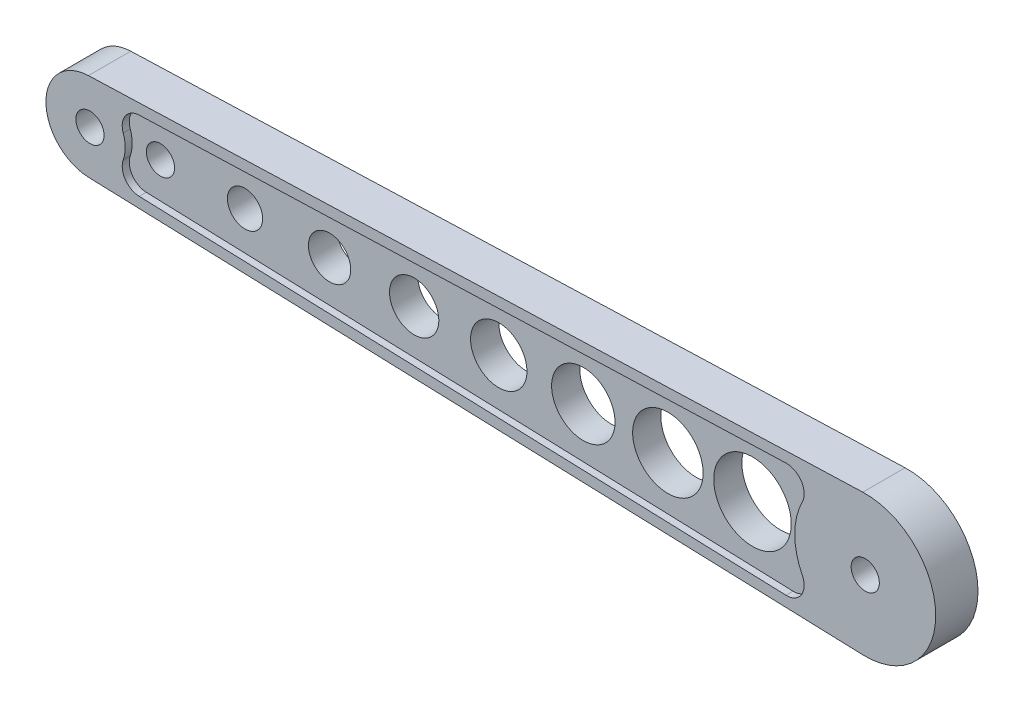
ISO-10303-21;
HEADER;
FILE_DESCRIPTION(('STEP AP214'),'2;1');
FILE_NAME('part.step','',(''),(''),'','','');
FILE_SCHEMA(('AUTOMOTIVE_DESIGN { 1 0 10303 214 1 1 1 1 }'));
ENDSEC;
DATA;
#1=APPLICATION_CONTEXT('core data for automotive mechanical design processes');
#2=APPLICATION_PROTOCOL_DEFINITION('international standard','automotive_design',2000,#1);
#3=PRODUCT_CONTEXT('',#1,'mechanical');
#4=PRODUCT('Part','Part','',(#3));
#5=PRODUCT_RELATED_PRODUCT_CATEGORY('part','',(#4));
#6=PRODUCT_DEFINITION_FORMATION('','',#4);
#7=PRODUCT_DEFINITION_CONTEXT('part definition',#1,'design');
#8=PRODUCT_DEFINITION('design','',#6,#7);
#9=PRODUCT_DEFINITION_SHAPE('','',#8);
#10=(LENGTH_UNIT() NAMED_UNIT(*) SI_UNIT(.MILLI.,.METRE.));
#11=(NAMED_UNIT(*) PLANE_ANGLE_UNIT() SI_UNIT($,.RADIAN.));
#12=(NAMED_UNIT(*) SI_UNIT($,.STERADIAN.) SOLID_ANGLE_UNIT());
#13=UNCERTAINTY_MEASURE_WITH_UNIT(LENGTH_MEASURE(1.E-05),#10,'distance_accuracy_value','');
#14=(GEOMETRIC_REPRESENTATION_CONTEXT(3) GLOBAL_UNCERTAINTY_ASSIGNED_CONTEXT((#13)) GLOBAL_UNIT_ASSIGNED_CONTEXT((#10,
#11,#12)) REPRESENTATION_CONTEXT('',''));
#15=CARTESIAN_POINT('',(0.,0.,0.));
#16=DIRECTION('',(0.,0.,1.));
#17=DIRECTION('',(1.,0.,0.));
#18=AXIS2_PLACEMENT_3D('',#15,#16,#17);
#19=CARTESIAN_POINT('',(-220.,0.,0.));
#20=DIRECTION('',(0.,0.,1.));
#21=DIRECTION('',(1.,0.,0.));
#22=AXIS2_PLACEMENT_3D('',#19,#20,#21);
#23=PLANE('',#22);
#24=CARTESIAN_POINT('',(0.,0.,0.));
#25=DIRECTION('',(0.,0.,1.));
#26=DIRECTION('',(1.,0.,0.));
#27=AXIS2_PLACEMENT_3D('',#24,#25,#26);
#28=CIRCLE('',#27,4.);
#29=CARTESIAN_POINT('',(4.,0.,0.));
#30=VERTEX_POINT('',#29);
#31=EDGE_CURVE('E327',#30,#30,#28,.T.);
#32=ORIENTED_EDGE('',*,*,#31,.T.);
#33=EDGE_LOOP('',(#32));
#34=FACE_BOUND('',#33,.T.);
#35=CARTESIAN_POINT('',(-220.,0.,0.));
#36=DIRECTION('',(0.,0.,1.));
#37=DIRECTION('',(1.,0.,0.));
#38=AXIS2_PLACEMENT_3D('',#35,#36,#37);
#39=CIRCLE('',#38,3.99999999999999);
#40=CARTESIAN_POINT('',(-216.,0.,0.));
#41=VERTEX_POINT('',#40);
#42=EDGE_CURVE('E342',#41,#41,#39,.T.);
#43=ORIENTED_EDGE('',*,*,#42,.T.);
#44=EDGE_LOOP('',(#43));
#45=FACE_BOUND('',#44,.T.);
#46=CARTESIAN_POINT('',(-220.,0.,0.));
#47=DIRECTION('',(0.,0.,1.));
#48=DIRECTION('',(1.,0.,0.));
#49=AXIS2_PLACEMENT_3D('',#46,#47,#48);
#50=CIRCLE('',#49,12.5);
#51=CARTESIAN_POINT('',(-220.426136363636,12.4927342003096,0.));
#52=VERTEX_POINT('',#51);
#53=CARTESIAN_POINT('',(-220.426136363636,-12.4927342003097,0.));
#54=VERTEX_POINT('',#53);
#55=EDGE_CURVE('E199',#52,#54,#50,.T.);
#56=ORIENTED_EDGE('',*,*,#55,.F.);
#57=DIRECTION('',(-0.999418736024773,-0.0340909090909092,0.));
#58=VECTOR('',#57,1.);
#59=CARTESIAN_POINT('',(-220.426136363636,12.4927342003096,0.));
#60=LINE('',#59,#58);
#61=CARTESIAN_POINT('',(-0.681818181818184,19.9883747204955,0.));
#62=VERTEX_POINT('',#61);
#63=EDGE_CURVE('E195',#62,#52,#60,.T.);
#64=ORIENTED_EDGE('',*,*,#63,.F.);
#65=CARTESIAN_POINT('',(0.,0.,0.));
#66=DIRECTION('',(0.,0.,1.));
#67=DIRECTION('',(1.,0.,0.));
#68=AXIS2_PLACEMENT_3D('',#65,#66,#67);
#69=CIRCLE('',#68,20.);
#70=CARTESIAN_POINT('',(-0.681818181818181,-19.9883747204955,0.));
#71=VERTEX_POINT('',#70);
#72=EDGE_CURVE('E356',#71,#62,#69,.T.);
#73=ORIENTED_EDGE('',*,*,#72,.F.);
#74=DIRECTION('',(0.999418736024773,-0.0340909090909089,0.));
#75=VECTOR('',#74,1.);
#76=CARTESIAN_POINT('',(-220.426136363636,-12.4927342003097,0.));
#77=LINE('',#76,#75);
#78=EDGE_CURVE('E354',#54,#71,#77,.T.);
#79=ORIENTED_EDGE('',*,*,#78,.F.);
#80=EDGE_LOOP('',(#56,#64,#73,#79));
#81=FACE_BOUND('',#80,.T.);
#82=DIRECTION('',(-0.999418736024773,-0.0340909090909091,0.));
#83=VECTOR('',#82,1.);
#84=CARTESIAN_POINT('',(-11.1090752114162,16.6309484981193,0.));
#85=LINE('',#84,#83);
#86=CARTESIAN_POINT('',(-22.4985095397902,16.2424465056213,0.));
#87=VERTEX_POINT('',#86);
#88=CARTESIAN_POINT('',(-206.023092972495,9.98228781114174,0.));
#89=VERTEX_POINT('',#88);
#90=EDGE_CURVE('E300',#87,#89,#85,.T.);
#91=ORIENTED_EDGE('',*,*,#90,.T.);
#92=CARTESIAN_POINT('',(-205.85263842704,4.98519413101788,0.));
#93=DIRECTION('',(0.,0.,1.));
#94=DIRECTION('',(1.,0.,0.));
#95=AXIS2_PLACEMENT_3D('',#92,#93,#94);
#96=CIRCLE('',#95,5.);
#97=CARTESIAN_POINT('',(-210.568425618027,3.32346275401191,0.));
#98=VERTEX_POINT('',#97);
#99=EDGE_CURVE('E270',#89,#98,#96,.T.);
#100=ORIENTED_EDGE('',*,*,#99,.T.);
#101=CARTESIAN_POINT('',(-220.,0.,0.));
#102=DIRECTION('',(0.,0.,-1.));
#103=DIRECTION('',(1.,0.,0.));
#104=AXIS2_PLACEMENT_3D('',#101,#102,#103);
#105=CIRCLE('',#104,9.99999999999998);
#106=CARTESIAN_POINT('',(-210.568425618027,-3.32346275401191,0.));
#107=VERTEX_POINT('',#106);
#108=EDGE_CURVE('E296',#98,#107,#105,.T.);
#109=ORIENTED_EDGE('',*,*,#108,.T.);
#110=CARTESIAN_POINT('',(-205.85263842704,-4.98519413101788,0.));
#111=DIRECTION('',(0.,0.,1.));
#112=DIRECTION('',(1.,0.,0.));
#113=AXIS2_PLACEMENT_3D('',#110,#111,#112);
#114=CIRCLE('',#113,5.);
#115=CARTESIAN_POINT('',(-206.023092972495,-9.98228781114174,0.));
#116=VERTEX_POINT('',#115);
#117=EDGE_CURVE('E268',#107,#116,#114,.T.);
#118=ORIENTED_EDGE('',*,*,#117,.T.);
#119=DIRECTION('',(0.999418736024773,-0.0340909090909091,0.));
#120=VECTOR('',#119,1.);
#121=CARTESIAN_POINT('',(-217.203179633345,-9.6009268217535,0.));
#122=LINE('',#121,#120);
#123=CARTESIAN_POINT('',(-22.4985095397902,-16.2424465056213,0.));
#124=VERTEX_POINT('',#123);
#125=EDGE_CURVE('E311',#116,#124,#122,.T.);
#126=ORIENTED_EDGE('',*,*,#125,.T.);
#127=CARTESIAN_POINT('',(-22.3280549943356,-11.2453528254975,0.));
#128=DIRECTION('',(0.,0.,1.));
#129=DIRECTION('',(1.,0.,0.));
#130=AXIS2_PLACEMENT_3D('',#127,#128,#129);
#131=CIRCLE('',#130,5.);
#132=CARTESIAN_POINT('',(-17.8624439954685,-8.99628226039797,0.));
#133=VERTEX_POINT('',#132);
#134=EDGE_CURVE('E45',#124,#133,#131,.T.);
#135=ORIENTED_EDGE('',*,*,#134,.T.);
#136=CARTESIAN_POINT('',(0.,0.,0.));
#137=DIRECTION('',(0.,0.,-1.));
#138=DIRECTION('',(1.,0.,0.));
#139=AXIS2_PLACEMENT_3D('',#136,#137,#138);
#140=CIRCLE('',#139,20.);
#141=CARTESIAN_POINT('',(-17.8624439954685,8.99628226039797,0.));
#142=VERTEX_POINT('',#141);
#143=EDGE_CURVE('E304',#133,#142,#140,.T.);
#144=ORIENTED_EDGE('',*,*,#143,.T.);
#145=CARTESIAN_POINT('',(-22.3280549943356,11.2453528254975,0.));
#146=DIRECTION('',(0.,0.,1.));
#147=DIRECTION('',(1.,0.,0.));
#148=AXIS2_PLACEMENT_3D('',#145,#146,#147);
#149=CIRCLE('',#148,5.);
#150=EDGE_CURVE('E11',#142,#87,#149,.T.);
#151=ORIENTED_EDGE('',*,*,#150,.T.);
#152=EDGE_LOOP('',(#91,#100,#109,#118,#126,#135,#144,#151));
#153=FACE_BOUND('',#152,.T.);
#154=ADVANCED_FACE('F36',(#34,#45,#81,#153),#23,.F.);
#155=CARTESIAN_POINT('',(-220.,0.,12.));
#156=DIRECTION('',(0.,0.,1.));
#157=DIRECTION('',(1.,0.,0.));
#158=AXIS2_PLACEMENT_3D('',#155,#156,#157);
#159=PLANE('',#158);
#160=CARTESIAN_POINT('',(-220.,0.,12.));
#161=DIRECTION('',(0.,0.,-1.));
#162=DIRECTION('',(1.,0.,0.));
#163=AXIS2_PLACEMENT_3D('',#160,#161,#162);
#164=CIRCLE('',#163,9.99999999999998);
#165=CARTESIAN_POINT('',(-210.568425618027,3.32346275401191,12.));
#166=VERTEX_POINT('',#165);
#167=CARTESIAN_POINT('',(-210.568425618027,-3.32346275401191,12.));
#168=VERTEX_POINT('',#167);
#169=EDGE_CURVE('E328',#166,#168,#164,.T.);
#170=ORIENTED_EDGE('',*,*,#169,.F.);
#171=CARTESIAN_POINT('',(-205.85263842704,4.98519413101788,12.));
#172=DIRECTION('',(0.,0.,1.));
#173=DIRECTION('',(1.,0.,0.));
#174=AXIS2_PLACEMENT_3D('',#171,#172,#173);
#175=CIRCLE('',#174,5.);
#176=CARTESIAN_POINT('',(-206.023092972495,9.98228781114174,12.));
#177=VERTEX_POINT('',#176);
#178=EDGE_CURVE('E239',#166,#177,#175,.F.);
#179=ORIENTED_EDGE('',*,*,#178,.T.);
#180=DIRECTION('',(-0.999418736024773,-0.0340909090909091,0.));
#181=VECTOR('',#180,1.);
#182=CARTESIAN_POINT('',(-11.1090752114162,16.6309484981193,12.));
#183=LINE('',#182,#181);
#184=CARTESIAN_POINT('',(-22.4985095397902,16.2424465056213,12.));
#185=VERTEX_POINT('',#184);
#186=EDGE_CURVE('E318',#185,#177,#183,.T.);
#187=ORIENTED_EDGE('',*,*,#186,.F.);
#188=CARTESIAN_POINT('',(-22.3280549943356,11.2453528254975,12.));
#189=DIRECTION('',(0.,0.,1.));
#190=DIRECTION('',(1.,0.,0.));
#191=AXIS2_PLACEMENT_3D('',#188,#189,#190);
#192=CIRCLE('',#191,5.);
#193=CARTESIAN_POINT('',(-17.8624439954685,8.99628226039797,12.));
#194=VERTEX_POINT('',#193);
#195=EDGE_CURVE('E235',#185,#194,#192,.F.);
#196=ORIENTED_EDGE('',*,*,#195,.T.);
#197=CARTESIAN_POINT('',(0.,0.,12.));
#198=DIRECTION('',(0.,0.,-1.));
#199=DIRECTION('',(1.,0.,0.));
#200=AXIS2_PLACEMENT_3D('',#197,#198,#199);
#201=CIRCLE('',#200,20.);
#202=CARTESIAN_POINT('',(-17.8624439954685,-8.99628226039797,12.));
#203=VERTEX_POINT('',#202);
#204=EDGE_CURVE('E334',#203,#194,#201,.T.);
#205=ORIENTED_EDGE('',*,*,#204,.F.);
#206=CARTESIAN_POINT('',(-22.3280549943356,-11.2453528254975,12.));
#207=DIRECTION('',(0.,0.,1.));
#208=DIRECTION('',(1.,0.,0.));
#209=AXIS2_PLACEMENT_3D('',#206,#207,#208);
#210=CIRCLE('',#209,5.);
#211=CARTESIAN_POINT('',(-22.4985095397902,-16.2424465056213,12.));
#212=VERTEX_POINT('',#211);
#213=EDGE_CURVE('E233',#203,#212,#210,.F.);
#214=ORIENTED_EDGE('',*,*,#213,.T.);
#215=DIRECTION('',(0.999418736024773,-0.0340909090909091,0.));
#216=VECTOR('',#215,1.);
#217=CARTESIAN_POINT('',(-217.203179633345,-9.6009268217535,12.));
#218=LINE('',#217,#216);
#219=CARTESIAN_POINT('',(-206.023092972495,-9.98228781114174,12.));
#220=VERTEX_POINT('',#219);
#221=EDGE_CURVE('E331',#220,#212,#218,.T.);
#222=ORIENTED_EDGE('',*,*,#221,.F.);
#223=CARTESIAN_POINT('',(-205.85263842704,-4.98519413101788,12.));
#224=DIRECTION('',(0.,0.,1.));
#225=DIRECTION('',(1.,0.,0.));
#226=AXIS2_PLACEMENT_3D('',#223,#224,#225);
#227=CIRCLE('',#226,5.);
#228=EDGE_CURVE('E237',#220,#168,#227,.F.);
#229=ORIENTED_EDGE('',*,*,#228,.T.);
#230=EDGE_LOOP('',(#170,#179,#187,#196,#205,#214,#222,#229));
#231=FACE_BOUND('',#230,.T.);
#232=CARTESIAN_POINT('',(-220.,0.,12.));
#233=DIRECTION('',(0.,0.,1.));
#234=DIRECTION('',(1.,0.,0.));
#235=AXIS2_PLACEMENT_3D('',#232,#233,#234);
#236=CIRCLE('',#235,3.99999999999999);
#237=CARTESIAN_POINT('',(-216.,0.,12.));
#238=VERTEX_POINT('',#237);
#239=EDGE_CURVE('E345',#238,#238,#236,.T.);
#240=ORIENTED_EDGE('',*,*,#239,.F.);
#241=EDGE_LOOP('',(#240));
#242=FACE_BOUND('',#241,.T.);
#243=CARTESIAN_POINT('',(-220.,0.,12.));
#244=DIRECTION('',(0.,0.,1.));
#245=DIRECTION('',(1.,0.,0.));
#246=AXIS2_PLACEMENT_3D('',#243,#244,#245);
#247=CIRCLE('',#246,12.5);
#248=CARTESIAN_POINT('',(-220.426136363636,12.4927342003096,12.));
#249=VERTEX_POINT('',#248);
#250=CARTESIAN_POINT('',(-220.426136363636,-12.4927342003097,12.));
#251=VERTEX_POINT('',#250);
#252=EDGE_CURVE('E185',#249,#251,#247,.T.);
#253=ORIENTED_EDGE('',*,*,#252,.T.);
#254=DIRECTION('',(0.999418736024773,-0.0340909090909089,0.));
#255=VECTOR('',#254,1.);
#256=CARTESIAN_POINT('',(-220.426136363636,-12.4927342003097,12.));
#257=LINE('',#256,#255);
#258=CARTESIAN_POINT('',(-0.681818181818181,-19.9883747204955,12.));
#259=VERTEX_POINT('',#258);
#260=EDGE_CURVE('E174',#251,#259,#257,.T.);
#261=ORIENTED_EDGE('',*,*,#260,.T.);
#262=CARTESIAN_POINT('',(0.,0.,12.));
#263=DIRECTION('',(0.,0.,1.));
#264=DIRECTION('',(1.,0.,0.));
#265=AXIS2_PLACEMENT_3D('',#262,#263,#264);
#266=CIRCLE('',#265,20.);
#267=CARTESIAN_POINT('',(-0.681818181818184,19.9883747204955,12.));
#268=VERTEX_POINT('',#267);
#269=EDGE_CURVE('E184',#259,#268,#266,.T.);
#270=ORIENTED_EDGE('',*,*,#269,.T.);
#271=DIRECTION('',(-0.999418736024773,-0.0340909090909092,0.));
#272=VECTOR('',#271,1.);
#273=CARTESIAN_POINT('',(-220.426136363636,12.4927342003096,12.));
#274=LINE('',#273,#272);
#275=EDGE_CURVE('E191',#268,#249,#274,.T.);
#276=ORIENTED_EDGE('',*,*,#275,.T.);
#277=EDGE_LOOP('',(#253,#261,#270,#276));
#278=FACE_BOUND('',#277,.T.);
#279=CARTESIAN_POINT('',(0.,0.,12.));
#280=DIRECTION('',(0.,0.,1.));
#281=DIRECTION('',(1.,0.,0.));
#282=AXIS2_PLACEMENT_3D('',#279,#280,#281);
#283=CIRCLE('',#282,4.);
#284=CARTESIAN_POINT('',(4.,0.,12.));
#285=VERTEX_POINT('',#284);
#286=EDGE_CURVE('E339',#285,#285,#283,.T.);
#287=ORIENTED_EDGE('',*,*,#286,.F.);
#288=EDGE_LOOP('',(#287));
#289=FACE_BOUND('',#288,.T.);
#290=ADVANCED_FACE('F188',(#231,#242,#278,#289),#159,.T.);
#291=CARTESIAN_POINT('',(-220.,0.,12.));
#292=DIRECTION('',(0.,0.,-1.));
#293=DIRECTION('',(-1.,0.,0.));
#294=AXIS2_PLACEMENT_3D('',#291,#292,#293);
#295=CYLINDRICAL_SURFACE('',#294,12.5);
#296=ORIENTED_EDGE('',*,*,#55,.T.);
#297=DIRECTION('',(0.,0.,-1.));
#298=VECTOR('',#297,1.);
#299=CARTESIAN_POINT('',(-220.426136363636,-12.4927342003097,12.));
#300=LINE('',#299,#298);
#301=EDGE_CURVE('E178',#251,#54,#300,.T.);
#302=ORIENTED_EDGE('',*,*,#301,.F.);
#303=ORIENTED_EDGE('',*,*,#252,.F.);
#304=DIRECTION('',(0.,0.,-1.));
#305=VECTOR('',#304,1.);
#306=CARTESIAN_POINT('',(-220.426136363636,12.4927342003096,12.));
#307=LINE('',#306,#305);
#308=EDGE_CURVE('E352',#249,#52,#307,.T.);
#309=ORIENTED_EDGE('',*,*,#308,.T.);
#310=EDGE_LOOP('',(#296,#302,#303,#309));
#311=FACE_BOUND('',#310,.T.);
#312=ADVANCED_FACE('F197',(#311),#295,.T.);
#313=CARTESIAN_POINT('',(-220.426136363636,-12.4927342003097,12.));
#314=DIRECTION('',(0.034090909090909,0.999418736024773,0.));
#315=DIRECTION('',(-0.999418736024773,0.034090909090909,0.));
#316=AXIS2_PLACEMENT_3D('',#313,#314,#315);
#317=PLANE('',#316);
#318=ORIENTED_EDGE('',*,*,#78,.T.);
#319=DIRECTION('',(0.,0.,-1.));
#320=VECTOR('',#319,1.);
#321=CARTESIAN_POINT('',(-0.681818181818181,-19.9883747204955,12.));
#322=LINE('',#321,#320);
#323=EDGE_CURVE('E181',#259,#71,#322,.T.);
#324=ORIENTED_EDGE('',*,*,#323,.F.);
#325=ORIENTED_EDGE('',*,*,#260,.F.);
#326=ORIENTED_EDGE('',*,*,#301,.T.);
#327=EDGE_LOOP('',(#318,#324,#325,#326));
#328=FACE_BOUND('',#327,.T.);
#329=ADVANCED_FACE('F176',(#328),#317,.F.);
#330=CARTESIAN_POINT('',(0.,0.,12.));
#331=DIRECTION('',(0.,0.,-1.));
#332=DIRECTION('',(-1.,0.,0.));
#333=AXIS2_PLACEMENT_3D('',#330,#331,#332);
#334=CYLINDRICAL_SURFACE('',#333,20.);
#335=ORIENTED_EDGE('',*,*,#72,.T.);
#336=DIRECTION('',(0.,0.,-1.));
#337=VECTOR('',#336,1.);
#338=CARTESIAN_POINT('',(-0.681818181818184,19.9883747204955,12.));
#339=LINE('',#338,#337);
#340=EDGE_CURVE('E204',#268,#62,#339,.T.);
#341=ORIENTED_EDGE('',*,*,#340,.F.);
#342=ORIENTED_EDGE('',*,*,#269,.F.);
#343=ORIENTED_EDGE('',*,*,#323,.T.);
#344=EDGE_LOOP('',(#335,#341,#342,#343));
#345=FACE_BOUND('',#344,.T.);
#346=ADVANCED_FACE('F367',(#345),#334,.T.);
#347=CARTESIAN_POINT('',(-220.426136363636,12.4927342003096,12.));
#348=DIRECTION('',(0.0340909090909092,-0.999418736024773,0.));
#349=DIRECTION('',(0.999418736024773,0.0340909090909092,0.));
#350=AXIS2_PLACEMENT_3D('',#347,#348,#349);
#351=PLANE('',#350);
#352=ORIENTED_EDGE('',*,*,#63,.T.);
#353=ORIENTED_EDGE('',*,*,#308,.F.);
#354=ORIENTED_EDGE('',*,*,#275,.F.);
#355=ORIENTED_EDGE('',*,*,#340,.T.);
#356=EDGE_LOOP('',(#352,#353,#354,#355));
#357=FACE_BOUND('',#356,.T.);
#358=ADVANCED_FACE('F363',(#357),#351,.F.);
#359=CARTESIAN_POINT('',(-220.,0.,12.));
#360=DIRECTION('',(0.,0.,-1.));
#361=DIRECTION('',(-1.,0.,0.));
#362=AXIS2_PLACEMENT_3D('',#359,#360,#361);
#363=CYLINDRICAL_SURFACE('',#362,3.99999999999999);
#364=ORIENTED_EDGE('',*,*,#239,.T.);
#365=EDGE_LOOP('',(#364));
#366=FACE_BOUND('',#365,.T.);
#367=ORIENTED_EDGE('',*,*,#42,.F.);
#368=EDGE_LOOP('',(#367));
#369=FACE_BOUND('',#368,.T.);
#370=ADVANCED_FACE('F374',(#366,#369),#363,.F.);
#371=CARTESIAN_POINT('',(0.,0.,12.));
#372=DIRECTION('',(0.,0.,-1.));
#373=DIRECTION('',(-1.,0.,0.));
#374=AXIS2_PLACEMENT_3D('',#371,#372,#373);
#375=CYLINDRICAL_SURFACE('',#374,4.);
#376=ORIENTED_EDGE('',*,*,#286,.T.);
#377=EDGE_LOOP('',(#376));
#378=FACE_BOUND('',#377,.T.);
#379=ORIENTED_EDGE('',*,*,#31,.F.);
#380=EDGE_LOOP('',(#379));
#381=FACE_BOUND('',#380,.T.);
#382=ADVANCED_FACE('F389',(#378,#381),#375,.F.);
#383=CARTESIAN_POINT('',(-220.,0.,10.));
#384=DIRECTION('',(0.,0.,1.));
#385=DIRECTION('',(1.,0.,0.));
#386=AXIS2_PLACEMENT_3D('',#383,#384,#385);
#387=CYLINDRICAL_SURFACE('',#386,9.99999999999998);
#388=ORIENTED_EDGE('',*,*,#169,.T.);
#389=DIRECTION('',(0.,0.,1.));
#390=VECTOR('',#389,1.);
#391=CARTESIAN_POINT('',(-210.568425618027,-3.32346275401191,10.));
#392=LINE('',#391,#390);
#393=CARTESIAN_POINT('',(-210.568425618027,-3.32346275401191,10.));
#394=VERTEX_POINT('',#393);
#395=EDGE_CURVE('E231',#168,#394,#392,.F.);
#396=ORIENTED_EDGE('',*,*,#395,.T.);
#397=CARTESIAN_POINT('',(-220.,0.,10.));
#398=DIRECTION('',(0.,0.,-1.));
#399=DIRECTION('',(1.,0.,0.));
#400=AXIS2_PLACEMENT_3D('',#397,#398,#399);
#401=CIRCLE('',#400,9.99999999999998);
#402=CARTESIAN_POINT('',(-210.568425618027,3.32346275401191,10.));
#403=VERTEX_POINT('',#402);
#404=EDGE_CURVE('E314',#403,#394,#401,.T.);
#405=ORIENTED_EDGE('',*,*,#404,.F.);
#406=DIRECTION('',(0.,0.,1.));
#407=VECTOR('',#406,1.);
#408=CARTESIAN_POINT('',(-210.568425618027,3.32346275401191,10.));
#409=LINE('',#408,#407);
#410=EDGE_CURVE('E228',#403,#166,#409,.T.);
#411=ORIENTED_EDGE('',*,*,#410,.T.);
#412=EDGE_LOOP('',(#388,#396,#405,#411));
#413=FACE_BOUND('',#412,.T.);
#414=ADVANCED_FACE('F393',(#413),#387,.T.);
#415=CARTESIAN_POINT('',(-11.1090752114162,16.6309484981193,10.));
#416=DIRECTION('',(-0.0340909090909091,0.999418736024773,0.));
#417=DIRECTION('',(-0.999418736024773,-0.0340909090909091,0.));
#418=AXIS2_PLACEMENT_3D('',#415,#416,#417);
#419=PLANE('',#418);
#420=DIRECTION('',(-0.999418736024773,-0.0340909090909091,0.));
#421=VECTOR('',#420,1.);
#422=CARTESIAN_POINT('',(-11.1090752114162,16.6309484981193,10.));
#423=LINE('',#422,#421);
#424=CARTESIAN_POINT('',(-22.4985095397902,16.2424465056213,10.));
#425=VERTEX_POINT('',#424);
#426=CARTESIAN_POINT('',(-206.023092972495,9.98228781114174,10.));
#427=VERTEX_POINT('',#426);
#428=EDGE_CURVE('E324',#425,#427,#423,.T.);
#429=ORIENTED_EDGE('',*,*,#428,.F.);
#430=DIRECTION('',(0.,0.,-1.));
#431=VECTOR('',#430,1.);
#432=CARTESIAN_POINT('',(-22.4985095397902,16.2424465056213,12.));
#433=LINE('',#432,#431);
#434=EDGE_CURVE('E225',#425,#185,#433,.F.);
#435=ORIENTED_EDGE('',*,*,#434,.T.);
#436=ORIENTED_EDGE('',*,*,#186,.T.);
#437=DIRECTION('',(0.,0.,-1.));
#438=VECTOR('',#437,1.);
#439=CARTESIAN_POINT('',(-206.023092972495,9.98228781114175,10.));
#440=LINE('',#439,#438);
#441=EDGE_CURVE('E223',#177,#427,#440,.T.);
#442=ORIENTED_EDGE('',*,*,#441,.T.);
#443=EDGE_LOOP('',(#429,#435,#436,#442));
#444=FACE_BOUND('',#443,.T.);
#445=ADVANCED_FACE('F397',(#444),#419,.F.);
#446=CARTESIAN_POINT('',(0.,0.,10.));
#447=DIRECTION('',(0.,0.,1.));
#448=DIRECTION('',(1.,0.,0.));
#449=AXIS2_PLACEMENT_3D('',#446,#447,#448);
#450=CYLINDRICAL_SURFACE('',#449,20.);
#451=CARTESIAN_POINT('',(0.,0.,10.));
#452=DIRECTION('',(0.,0.,-1.));
#453=DIRECTION('',(1.,0.,0.));
#454=AXIS2_PLACEMENT_3D('',#451,#452,#453);
#455=CIRCLE('',#454,20.);
#456=CARTESIAN_POINT('',(-17.8624439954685,-8.99628226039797,10.));
#457=VERTEX_POINT('',#456);
#458=CARTESIAN_POINT('',(-17.8624439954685,8.99628226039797,10.));
#459=VERTEX_POINT('',#458);
#460=EDGE_CURVE('E321',#457,#459,#455,.T.);
#461=ORIENTED_EDGE('',*,*,#460,.F.);
#462=DIRECTION('',(0.,0.,1.));
#463=VECTOR('',#462,1.);
#464=CARTESIAN_POINT('',(-17.8624439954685,-8.99628226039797,10.));
#465=LINE('',#464,#463);
#466=EDGE_CURVE('E202',#457,#203,#465,.T.);
#467=ORIENTED_EDGE('',*,*,#466,.T.);
#468=ORIENTED_EDGE('',*,*,#204,.T.);
#469=DIRECTION('',(0.,0.,1.));
#470=VECTOR('',#469,1.);
#471=CARTESIAN_POINT('',(-17.8624439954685,8.99628226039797,10.));
#472=LINE('',#471,#470);
#473=EDGE_CURVE('E200',#194,#459,#472,.F.);
#474=ORIENTED_EDGE('',*,*,#473,.T.);
#475=EDGE_LOOP('',(#461,#467,#468,#474));
#476=FACE_BOUND('',#475,.T.);
#477=ADVANCED_FACE('F403',(#476),#450,.T.);
#478=CARTESIAN_POINT('',(-217.203179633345,-9.6009268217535,10.));
#479=DIRECTION('',(-0.0340909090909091,-0.999418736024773,0.));
#480=DIRECTION('',(0.999418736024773,-0.0340909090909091,0.));
#481=AXIS2_PLACEMENT_3D('',#478,#479,#480);
#482=PLANE('',#481);
#483=ORIENTED_EDGE('',*,*,#221,.T.);
#484=DIRECTION('',(0.,0.,-1.));
#485=VECTOR('',#484,1.);
#486=CARTESIAN_POINT('',(-22.4985095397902,-16.2424465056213,10.));
#487=LINE('',#486,#485);
#488=CARTESIAN_POINT('',(-22.4985095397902,-16.2424465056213,10.));
#489=VERTEX_POINT('',#488);
#490=EDGE_CURVE('E213',#212,#489,#487,.T.);
#491=ORIENTED_EDGE('',*,*,#490,.T.);
#492=DIRECTION('',(0.999418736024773,-0.0340909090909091,0.));
#493=VECTOR('',#492,1.);
#494=CARTESIAN_POINT('',(-217.203179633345,-9.6009268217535,10.));
#495=LINE('',#494,#493);
#496=CARTESIAN_POINT('',(-206.023092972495,-9.98228781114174,10.));
#497=VERTEX_POINT('',#496);
#498=EDGE_CURVE('E317',#497,#489,#495,.T.);
#499=ORIENTED_EDGE('',*,*,#498,.F.);
#500=DIRECTION('',(0.,0.,-1.));
#501=VECTOR('',#500,1.);
#502=CARTESIAN_POINT('',(-206.023092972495,-9.98228781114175,12.));
#503=LINE('',#502,#501);
#504=EDGE_CURVE('E210',#497,#220,#503,.F.);
#505=ORIENTED_EDGE('',*,*,#504,.T.);
#506=EDGE_LOOP('',(#483,#491,#499,#505));
#507=FACE_BOUND('',#506,.T.);
#508=ADVANCED_FACE('F399',(#507),#482,.F.);
#509=CARTESIAN_POINT('',(-220.,0.,10.));
#510=DIRECTION('',(0.,0.,1.));
#511=DIRECTION('',(1.,0.,0.));
#512=AXIS2_PLACEMENT_3D('',#509,#510,#511);
#513=PLANE('',#512);
#514=CARTESIAN_POINT('',(-106.,0.,10.));
#515=DIRECTION('',(0.,0.,1.));
#516=DIRECTION('',(1.,0.,0.));
#517=AXIS2_PLACEMENT_3D('',#514,#515,#516);
#518=CIRCLE('',#517,7.99999999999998);
#519=CARTESIAN_POINT('',(-98.0000000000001,0.,10.));
#520=VERTEX_POINT('',#519);
#521=EDGE_CURVE('E483',#520,#520,#518,.T.);
#522=ORIENTED_EDGE('',*,*,#521,.F.);
#523=EDGE_LOOP('',(#522));
#524=FACE_BOUND('',#523,.T.);
#525=CARTESIAN_POINT('',(-202.,0.,10.));
#526=DIRECTION('',(0.,0.,1.));
#527=DIRECTION('',(1.,0.,0.));
#528=AXIS2_PLACEMENT_3D('',#525,#526,#527);
#529=CIRCLE('',#528,3.99999999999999);
#530=CARTESIAN_POINT('',(-198.,0.,10.));
#531=VERTEX_POINT('',#530);
#532=EDGE_CURVE('E277',#531,#531,#529,.T.);
#533=ORIENTED_EDGE('',*,*,#532,.F.);
#534=EDGE_LOOP('',(#533));
#535=FACE_BOUND('',#534,.T.);
#536=CARTESIAN_POINT('',(-178.,0.,10.));
#537=DIRECTION('',(0.,0.,1.));
#538=DIRECTION('',(1.,0.,0.));
#539=AXIS2_PLACEMENT_3D('',#536,#537,#538);
#540=CIRCLE('',#539,4.99999999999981);
#541=CARTESIAN_POINT('',(-173.,0.,10.));
#542=VERTEX_POINT('',#541);
#543=EDGE_CURVE('E472',#542,#542,#540,.T.);
#544=ORIENTED_EDGE('',*,*,#543,.F.);
#545=EDGE_LOOP('',(#544));
#546=FACE_BOUND('',#545,.T.);
#547=CARTESIAN_POINT('',(-154.,0.,10.));
#548=DIRECTION('',(0.,0.,1.));
#549=DIRECTION('',(1.,0.,0.));
#550=AXIS2_PLACEMENT_3D('',#547,#548,#549);
#551=CIRCLE('',#550,6.0000000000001);
#552=CARTESIAN_POINT('',(-148.,0.,10.));
#553=VERTEX_POINT('',#552);
#554=EDGE_CURVE('E475',#553,#553,#551,.T.);
#555=ORIENTED_EDGE('',*,*,#554,.F.);
#556=EDGE_LOOP('',(#555));
#557=FACE_BOUND('',#556,.T.);
#558=CARTESIAN_POINT('',(-130.,0.,10.));
#559=DIRECTION('',(0.,0.,1.));
#560=DIRECTION('',(1.,0.,0.));
#561=AXIS2_PLACEMENT_3D('',#558,#559,#560);
#562=CIRCLE('',#561,6.99999999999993);
#563=CARTESIAN_POINT('',(-123.,0.,10.));
#564=VERTEX_POINT('',#563);
#565=EDGE_CURVE('E480',#564,#564,#562,.T.);
#566=ORIENTED_EDGE('',*,*,#565,.F.);
#567=EDGE_LOOP('',(#566));
#568=FACE_BOUND('',#567,.T.);
#569=CARTESIAN_POINT('',(-82.0000000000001,0.,10.));
#570=DIRECTION('',(0.,0.,1.));
#571=DIRECTION('',(1.,0.,0.));
#572=AXIS2_PLACEMENT_3D('',#569,#570,#571);
#573=CIRCLE('',#572,8.99999999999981);
#574=CARTESIAN_POINT('',(-73.0000000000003,0.,10.));
#575=VERTEX_POINT('',#574);
#576=EDGE_CURVE('E486',#575,#575,#573,.T.);
#577=ORIENTED_EDGE('',*,*,#576,.F.);
#578=EDGE_LOOP('',(#577));
#579=FACE_BOUND('',#578,.T.);
#580=CARTESIAN_POINT('',(-58.,0.,10.));
#581=DIRECTION('',(0.,0.,1.));
#582=DIRECTION('',(1.,0.,0.));
#583=AXIS2_PLACEMENT_3D('',#580,#581,#582);
#584=CIRCLE('',#583,10.0000000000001);
#585=CARTESIAN_POINT('',(-48.,0.,10.));
#586=VERTEX_POINT('',#585);
#587=EDGE_CURVE('E489',#586,#586,#584,.T.);
#588=ORIENTED_EDGE('',*,*,#587,.F.);
#589=EDGE_LOOP('',(#588));
#590=FACE_BOUND('',#589,.T.);
#591=CARTESIAN_POINT('',(-34.,0.,10.));
#592=DIRECTION('',(0.,0.,1.));
#593=DIRECTION('',(1.,0.,0.));
#594=AXIS2_PLACEMENT_3D('',#591,#592,#593);
#595=CIRCLE('',#594,10.9999999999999);
#596=CARTESIAN_POINT('',(-23.0000000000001,0.,10.));
#597=VERTEX_POINT('',#596);
#598=EDGE_CURVE('E492',#597,#597,#595,.T.);
#599=ORIENTED_EDGE('',*,*,#598,.F.);
#600=EDGE_LOOP('',(#599));
#601=FACE_BOUND('',#600,.T.);
#602=ORIENTED_EDGE('',*,*,#498,.T.);
#603=CARTESIAN_POINT('',(-22.3280549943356,-11.2453528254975,10.));
#604=DIRECTION('',(0.,0.,1.));
#605=DIRECTION('',(1.,0.,0.));
#606=AXIS2_PLACEMENT_3D('',#603,#604,#605);
#607=CIRCLE('',#606,5.);
#608=EDGE_CURVE('E221',#489,#457,#607,.T.);
#609=ORIENTED_EDGE('',*,*,#608,.T.);
#610=ORIENTED_EDGE('',*,*,#460,.T.);
#611=CARTESIAN_POINT('',(-22.3280549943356,11.2453528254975,10.));
#612=DIRECTION('',(0.,0.,1.));
#613=DIRECTION('',(1.,0.,0.));
#614=AXIS2_PLACEMENT_3D('',#611,#612,#613);
#615=CIRCLE('',#614,5.);
#616=EDGE_CURVE('E219',#459,#425,#615,.T.);
#617=ORIENTED_EDGE('',*,*,#616,.T.);
#618=ORIENTED_EDGE('',*,*,#428,.T.);
#619=CARTESIAN_POINT('',(-205.85263842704,4.98519413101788,10.));
#620=DIRECTION('',(0.,0.,1.));
#621=DIRECTION('',(1.,0.,0.));
#622=AXIS2_PLACEMENT_3D('',#619,#620,#621);
#623=CIRCLE('',#622,5.);
#624=EDGE_CURVE('E215',#427,#403,#623,.T.);
#625=ORIENTED_EDGE('',*,*,#624,.T.);
#626=ORIENTED_EDGE('',*,*,#404,.T.);
#627=CARTESIAN_POINT('',(-205.85263842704,-4.98519413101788,10.));
#628=DIRECTION('',(0.,0.,1.));
#629=DIRECTION('',(1.,0.,0.));
#630=AXIS2_PLACEMENT_3D('',#627,#628,#629);
#631=CIRCLE('',#630,5.);
#632=EDGE_CURVE('E217',#394,#497,#631,.T.);
#633=ORIENTED_EDGE('',*,*,#632,.T.);
#634=EDGE_LOOP('',(#602,#609,#610,#617,#618,#625,#626,#633));
#635=FACE_BOUND('',#634,.T.);
#636=ADVANCED_FACE('F402',(#524,#535,#546,#557,#568,#579,#590,#601,#635),#513,.T.);
#637=CARTESIAN_POINT('',(-22.3280549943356,-11.2453528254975,10.));
#638=DIRECTION('',(0.,0.,1.));
#639=DIRECTION('',(1.,0.,0.));
#640=AXIS2_PLACEMENT_3D('',#637,#638,#639);
#641=CYLINDRICAL_SURFACE('',#640,5.);
#642=ORIENTED_EDGE('',*,*,#608,.F.);
#643=ORIENTED_EDGE('',*,*,#490,.F.);
#644=ORIENTED_EDGE('',*,*,#213,.F.);
#645=ORIENTED_EDGE('',*,*,#466,.F.);
#646=EDGE_LOOP('',(#642,#643,#644,#645));
#647=FACE_BOUND('',#646,.T.);
#648=ADVANCED_FACE('F413',(#647),#641,.F.);
#649=CARTESIAN_POINT('',(-22.3280549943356,11.2453528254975,10.));
#650=DIRECTION('',(0.,0.,1.));
#651=DIRECTION('',(1.,0.,0.));
#652=AXIS2_PLACEMENT_3D('',#649,#650,#651);
#653=CYLINDRICAL_SURFACE('',#652,5.);
#654=ORIENTED_EDGE('',*,*,#616,.F.);
#655=ORIENTED_EDGE('',*,*,#473,.F.);
#656=ORIENTED_EDGE('',*,*,#195,.F.);
#657=ORIENTED_EDGE('',*,*,#434,.F.);
#658=EDGE_LOOP('',(#654,#655,#656,#657));
#659=FACE_BOUND('',#658,.T.);
#660=ADVANCED_FACE('F645',(#659),#653,.F.);
#661=CARTESIAN_POINT('',(-205.85263842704,-4.98519413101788,10.));
#662=DIRECTION('',(0.,0.,1.));
#663=DIRECTION('',(1.,0.,0.));
#664=AXIS2_PLACEMENT_3D('',#661,#662,#663);
#665=CYLINDRICAL_SURFACE('',#664,5.);
#666=ORIENTED_EDGE('',*,*,#632,.F.);
#667=ORIENTED_EDGE('',*,*,#395,.F.);
#668=ORIENTED_EDGE('',*,*,#228,.F.);
#669=ORIENTED_EDGE('',*,*,#504,.F.);
#670=EDGE_LOOP('',(#666,#667,#668,#669));
#671=FACE_BOUND('',#670,.T.);
#672=ADVANCED_FACE('F637',(#671),#665,.F.);
#673=CARTESIAN_POINT('',(-205.85263842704,4.98519413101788,10.));
#674=DIRECTION('',(0.,0.,1.));
#675=DIRECTION('',(1.,0.,0.));
#676=AXIS2_PLACEMENT_3D('',#673,#674,#675);
#677=CYLINDRICAL_SURFACE('',#676,5.);
#678=ORIENTED_EDGE('',*,*,#624,.F.);
#679=ORIENTED_EDGE('',*,*,#441,.F.);
#680=ORIENTED_EDGE('',*,*,#178,.F.);
#681=ORIENTED_EDGE('',*,*,#410,.F.);
#682=EDGE_LOOP('',(#678,#679,#680,#681));
#683=FACE_BOUND('',#682,.T.);
#684=ADVANCED_FACE('F419',(#683),#677,.F.);
#685=CARTESIAN_POINT('',(-220.,0.,2.));
#686=DIRECTION('',(0.,0.,-1.));
#687=DIRECTION('',(-1.,0.,0.));
#688=AXIS2_PLACEMENT_3D('',#685,#686,#687);
#689=CYLINDRICAL_SURFACE('',#688,9.99999999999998);
#690=CARTESIAN_POINT('',(-220.,0.,2.));
#691=DIRECTION('',(0.,0.,-1.));
#692=DIRECTION('',(1.,0.,0.));
#693=AXIS2_PLACEMENT_3D('',#690,#691,#692);
#694=CIRCLE('',#693,9.99999999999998);
#695=CARTESIAN_POINT('',(-210.568425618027,3.32346275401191,2.));
#696=VERTEX_POINT('',#695);
#697=CARTESIAN_POINT('',(-210.568425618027,-3.32346275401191,2.));
#698=VERTEX_POINT('',#697);
#699=EDGE_CURVE('E313',#696,#698,#694,.T.);
#700=ORIENTED_EDGE('',*,*,#699,.T.);
#701=DIRECTION('',(0.,0.,-1.));
#702=VECTOR('',#701,1.);
#703=CARTESIAN_POINT('',(-210.568425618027,-3.32346275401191,2.));
#704=LINE('',#703,#702);
#705=EDGE_CURVE('E243',#698,#107,#704,.T.);
#706=ORIENTED_EDGE('',*,*,#705,.T.);
#707=ORIENTED_EDGE('',*,*,#108,.F.);
#708=DIRECTION('',(0.,0.,-1.));
#709=VECTOR('',#708,1.);
#710=CARTESIAN_POINT('',(-210.568425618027,3.32346275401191,2.));
#711=LINE('',#710,#709);
#712=EDGE_CURVE('E241',#98,#696,#711,.F.);
#713=ORIENTED_EDGE('',*,*,#712,.T.);
#714=EDGE_LOOP('',(#700,#706,#707,#713));
#715=FACE_BOUND('',#714,.T.);
#716=ADVANCED_FACE('F415',(#715),#689,.T.);
#717=CARTESIAN_POINT('',(-217.203179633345,-9.6009268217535,2.));
#718=DIRECTION('',(0.0340909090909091,0.999418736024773,0.));
#719=DIRECTION('',(-0.999418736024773,0.0340909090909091,0.));
#720=AXIS2_PLACEMENT_3D('',#717,#718,#719);
#721=PLANE('',#720);
#722=ORIENTED_EDGE('',*,*,#125,.F.);
#723=DIRECTION('',(0.,0.,1.));
#724=VECTOR('',#723,1.);
#725=CARTESIAN_POINT('',(-206.023092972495,-9.98228781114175,2.));
#726=LINE('',#725,#724);
#727=CARTESIAN_POINT('',(-206.023092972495,-9.98228781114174,2.));
#728=VERTEX_POINT('',#727);
#729=EDGE_CURVE('E249',#116,#728,#726,.T.);
#730=ORIENTED_EDGE('',*,*,#729,.T.);
#731=DIRECTION('',(0.999418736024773,-0.0340909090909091,0.));
#732=VECTOR('',#731,1.);
#733=CARTESIAN_POINT('',(-217.203179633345,-9.6009268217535,2.));
#734=LINE('',#733,#732);
#735=CARTESIAN_POINT('',(-22.4985095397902,-16.2424465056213,2.));
#736=VERTEX_POINT('',#735);
#737=EDGE_CURVE('E307',#728,#736,#734,.T.);
#738=ORIENTED_EDGE('',*,*,#737,.T.);
#739=DIRECTION('',(0.,0.,1.));
#740=VECTOR('',#739,1.);
#741=CARTESIAN_POINT('',(-22.4985095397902,-16.2424465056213,0.));
#742=LINE('',#741,#740);
#743=EDGE_CURVE('E246',#736,#124,#742,.F.);
#744=ORIENTED_EDGE('',*,*,#743,.T.);
#745=EDGE_LOOP('',(#722,#730,#738,#744));
#746=FACE_BOUND('',#745,.T.);
#747=ADVANCED_FACE('F418',(#746),#721,.T.);
#748=CARTESIAN_POINT('',(0.,0.,2.));
#749=DIRECTION('',(0.,0.,-1.));
#750=DIRECTION('',(-1.,0.,0.));
#751=AXIS2_PLACEMENT_3D('',#748,#749,#750);
#752=CYLINDRICAL_SURFACE('',#751,20.);
#753=ORIENTED_EDGE('',*,*,#143,.F.);
#754=DIRECTION('',(0.,0.,-1.));
#755=VECTOR('',#754,1.);
#756=CARTESIAN_POINT('',(-17.8624439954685,-8.99628226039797,2.));
#757=LINE('',#756,#755);
#758=CARTESIAN_POINT('',(-17.8624439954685,-8.99628226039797,2.));
#759=VERTEX_POINT('',#758);
#760=EDGE_CURVE('E266',#133,#759,#757,.F.);
#761=ORIENTED_EDGE('',*,*,#760,.T.);
#762=CARTESIAN_POINT('',(0.,0.,2.));
#763=DIRECTION('',(0.,0.,-1.));
#764=DIRECTION('',(1.,0.,0.));
#765=AXIS2_PLACEMENT_3D('',#762,#763,#764);
#766=CIRCLE('',#765,20.);
#767=CARTESIAN_POINT('',(-17.8624439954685,8.99628226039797,2.));
#768=VERTEX_POINT('',#767);
#769=EDGE_CURVE('E499',#759,#768,#766,.T.);
#770=ORIENTED_EDGE('',*,*,#769,.T.);
#771=DIRECTION('',(0.,0.,-1.));
#772=VECTOR('',#771,1.);
#773=CARTESIAN_POINT('',(-17.8624439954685,8.99628226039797,2.));
#774=LINE('',#773,#772);
#775=EDGE_CURVE('E264',#768,#142,#774,.T.);
#776=ORIENTED_EDGE('',*,*,#775,.T.);
#777=EDGE_LOOP('',(#753,#761,#770,#776));
#778=FACE_BOUND('',#777,.T.);
#779=ADVANCED_FACE('F425',(#778),#752,.T.);
#780=CARTESIAN_POINT('',(-11.1090752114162,16.6309484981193,2.));
#781=DIRECTION('',(0.0340909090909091,-0.999418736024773,0.));
#782=DIRECTION('',(0.999418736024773,0.0340909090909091,0.));
#783=AXIS2_PLACEMENT_3D('',#780,#781,#782);
#784=PLANE('',#783);
#785=DIRECTION('',(-0.999418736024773,-0.0340909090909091,0.));
#786=VECTOR('',#785,1.);
#787=CARTESIAN_POINT('',(-11.1090752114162,16.6309484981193,2.));
#788=LINE('',#787,#786);
#789=CARTESIAN_POINT('',(-22.4985095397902,16.2424465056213,2.));
#790=VERTEX_POINT('',#789);
#791=CARTESIAN_POINT('',(-206.023092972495,9.98228781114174,2.));
#792=VERTEX_POINT('',#791);
#793=EDGE_CURVE('E497',#790,#792,#788,.T.);
#794=ORIENTED_EDGE('',*,*,#793,.T.);
#795=DIRECTION('',(0.,0.,1.));
#796=VECTOR('',#795,1.);
#797=CARTESIAN_POINT('',(-206.023092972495,9.98228781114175,0.));
#798=LINE('',#797,#796);
#799=EDGE_CURVE('E261',#792,#89,#798,.F.);
#800=ORIENTED_EDGE('',*,*,#799,.T.);
#801=ORIENTED_EDGE('',*,*,#90,.F.);
#802=DIRECTION('',(0.,0.,1.));
#803=VECTOR('',#802,1.);
#804=CARTESIAN_POINT('',(-22.4985095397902,16.2424465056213,2.));
#805=LINE('',#804,#803);
#806=EDGE_CURVE('E259',#87,#790,#805,.T.);
#807=ORIENTED_EDGE('',*,*,#806,.T.);
#808=EDGE_LOOP('',(#794,#800,#801,#807));
#809=FACE_BOUND('',#808,.T.);
#810=ADVANCED_FACE('F421',(#809),#784,.T.);
#811=CARTESIAN_POINT('',(-220.,0.,2.));
#812=DIRECTION('',(0.,0.,-1.));
#813=DIRECTION('',(1.,0.,0.));
#814=AXIS2_PLACEMENT_3D('',#811,#812,#813);
#815=PLANE('',#814);
#816=CARTESIAN_POINT('',(-202.,0.,2.));
#817=DIRECTION('',(0.,0.,-1.));
#818=DIRECTION('',(-1.,0.,0.));
#819=AXIS2_PLACEMENT_3D('',#816,#817,#818);
#820=CIRCLE('',#819,3.99999999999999);
#821=CARTESIAN_POINT('',(-206.,0.,2.));
#822=VERTEX_POINT('',#821);
#823=EDGE_CURVE('E40',#822,#822,#820,.T.);
#824=ORIENTED_EDGE('',*,*,#823,.F.);
#825=EDGE_LOOP('',(#824));
#826=FACE_BOUND('',#825,.T.);
#827=CARTESIAN_POINT('',(-178.,0.,2.));
#828=DIRECTION('',(0.,0.,-1.));
#829=DIRECTION('',(-1.,0.,0.));
#830=AXIS2_PLACEMENT_3D('',#827,#828,#829);
#831=CIRCLE('',#830,4.99999999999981);
#832=CARTESIAN_POINT('',(-183.,0.,2.));
#833=VERTEX_POINT('',#832);
#834=EDGE_CURVE('E291',#833,#833,#831,.T.);
#835=ORIENTED_EDGE('',*,*,#834,.F.);
#836=EDGE_LOOP('',(#835));
#837=FACE_BOUND('',#836,.T.);
#838=CARTESIAN_POINT('',(-154.,0.,2.));
#839=DIRECTION('',(0.,0.,-1.));
#840=DIRECTION('',(-1.,0.,0.));
#841=AXIS2_PLACEMENT_3D('',#838,#839,#840);
#842=CIRCLE('',#841,6.0000000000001);
#843=CARTESIAN_POINT('',(-160.,0.,2.));
#844=VERTEX_POINT('',#843);
#845=EDGE_CURVE('E289',#844,#844,#842,.T.);
#846=ORIENTED_EDGE('',*,*,#845,.F.);
#847=EDGE_LOOP('',(#846));
#848=FACE_BOUND('',#847,.T.);
#849=CARTESIAN_POINT('',(-130.,0.,2.));
#850=DIRECTION('',(0.,0.,-1.));
#851=DIRECTION('',(-1.,0.,0.));
#852=AXIS2_PLACEMENT_3D('',#849,#850,#851);
#853=CIRCLE('',#852,6.99999999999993);
#854=CARTESIAN_POINT('',(-137.,0.,2.));
#855=VERTEX_POINT('',#854);
#856=EDGE_CURVE('E286',#855,#855,#853,.T.);
#857=ORIENTED_EDGE('',*,*,#856,.F.);
#858=EDGE_LOOP('',(#857));
#859=FACE_BOUND('',#858,.T.);
#860=CARTESIAN_POINT('',(-106.,0.,2.));
#861=DIRECTION('',(0.,0.,-1.));
#862=DIRECTION('',(-1.,0.,0.));
#863=AXIS2_PLACEMENT_3D('',#860,#861,#862);
#864=CIRCLE('',#863,7.99999999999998);
#865=CARTESIAN_POINT('',(-114.,0.,2.));
#866=VERTEX_POINT('',#865);
#867=EDGE_CURVE('E283',#866,#866,#864,.T.);
#868=ORIENTED_EDGE('',*,*,#867,.F.);
#869=EDGE_LOOP('',(#868));
#870=FACE_BOUND('',#869,.T.);
#871=CARTESIAN_POINT('',(-82.0000000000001,0.,2.));
#872=DIRECTION('',(0.,0.,-1.));
#873=DIRECTION('',(-1.,0.,0.));
#874=AXIS2_PLACEMENT_3D('',#871,#872,#873);
#875=CIRCLE('',#874,8.99999999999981);
#876=CARTESIAN_POINT('',(-90.9999999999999,0.,2.));
#877=VERTEX_POINT('',#876);
#878=EDGE_CURVE('E280',#877,#877,#875,.T.);
#879=ORIENTED_EDGE('',*,*,#878,.F.);
#880=EDGE_LOOP('',(#879));
#881=FACE_BOUND('',#880,.T.);
#882=CARTESIAN_POINT('',(-58.,0.,2.));
#883=DIRECTION('',(0.,0.,-1.));
#884=DIRECTION('',(-1.,0.,0.));
#885=AXIS2_PLACEMENT_3D('',#882,#883,#884);
#886=CIRCLE('',#885,10.0000000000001);
#887=CARTESIAN_POINT('',(-68.0000000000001,0.,2.));
#888=VERTEX_POINT('',#887);
#889=EDGE_CURVE('E276',#888,#888,#886,.T.);
#890=ORIENTED_EDGE('',*,*,#889,.F.);
#891=EDGE_LOOP('',(#890));
#892=FACE_BOUND('',#891,.T.);
#893=CARTESIAN_POINT('',(-34.,0.,2.));
#894=DIRECTION('',(0.,0.,-1.));
#895=DIRECTION('',(-1.,0.,0.));
#896=AXIS2_PLACEMENT_3D('',#893,#894,#895);
#897=CIRCLE('',#896,10.9999999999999);
#898=CARTESIAN_POINT('',(-45.,0.,2.));
#899=VERTEX_POINT('',#898);
#900=EDGE_CURVE('E273',#899,#899,#897,.T.);
#901=ORIENTED_EDGE('',*,*,#900,.F.);
#902=EDGE_LOOP('',(#901));
#903=FACE_BOUND('',#902,.T.);
#904=ORIENTED_EDGE('',*,*,#737,.F.);
#905=CARTESIAN_POINT('',(-205.85263842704,-4.98519413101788,2.));
#906=DIRECTION('',(0.,0.,-1.));
#907=DIRECTION('',(-1.,0.,0.));
#908=AXIS2_PLACEMENT_3D('',#905,#906,#907);
#909=CIRCLE('',#908,5.);
#910=EDGE_CURVE('E257',#728,#698,#909,.T.);
#911=ORIENTED_EDGE('',*,*,#910,.T.);
#912=ORIENTED_EDGE('',*,*,#699,.F.);
#913=CARTESIAN_POINT('',(-205.85263842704,4.98519413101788,2.));
#914=DIRECTION('',(0.,0.,-1.));
#915=DIRECTION('',(-1.,0.,0.));
#916=AXIS2_PLACEMENT_3D('',#913,#914,#915);
#917=CIRCLE('',#916,5.);
#918=EDGE_CURVE('E255',#696,#792,#917,.T.);
#919=ORIENTED_EDGE('',*,*,#918,.T.);
#920=ORIENTED_EDGE('',*,*,#793,.F.);
#921=CARTESIAN_POINT('',(-22.3280549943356,11.2453528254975,2.));
#922=DIRECTION('',(0.,0.,-1.));
#923=DIRECTION('',(-1.,0.,0.));
#924=AXIS2_PLACEMENT_3D('',#921,#922,#923);
#925=CIRCLE('',#924,5.);
#926=EDGE_CURVE('E251',#790,#768,#925,.T.);
#927=ORIENTED_EDGE('',*,*,#926,.T.);
#928=ORIENTED_EDGE('',*,*,#769,.F.);
#929=CARTESIAN_POINT('',(-22.3280549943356,-11.2453528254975,2.));
#930=DIRECTION('',(0.,0.,-1.));
#931=DIRECTION('',(-1.,0.,0.));
#932=AXIS2_PLACEMENT_3D('',#929,#930,#931);
#933=CIRCLE('',#932,5.);
#934=EDGE_CURVE('E253',#759,#736,#933,.T.);
#935=ORIENTED_EDGE('',*,*,#934,.T.);
#936=EDGE_LOOP('',(#904,#911,#912,#919,#920,#927,#928,#935));
#937=FACE_BOUND('',#936,.T.);
#938=ADVANCED_FACE('F424',(#826,#837,#848,#859,#870,#881,#892,#903,#937),#815,.T.);
#939=CARTESIAN_POINT('',(-205.85263842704,-4.98519413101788,2.));
#940=DIRECTION('',(0.,0.,-1.));
#941=DIRECTION('',(-1.,0.,0.));
#942=AXIS2_PLACEMENT_3D('',#939,#940,#941);
#943=CYLINDRICAL_SURFACE('',#942,5.);
#944=ORIENTED_EDGE('',*,*,#910,.F.);
#945=ORIENTED_EDGE('',*,*,#729,.F.);
#946=ORIENTED_EDGE('',*,*,#117,.F.);
#947=ORIENTED_EDGE('',*,*,#705,.F.);
#948=EDGE_LOOP('',(#944,#945,#946,#947));
#949=FACE_BOUND('',#948,.T.);
#950=ADVANCED_FACE('F435',(#949),#943,.F.);
#951=CARTESIAN_POINT('',(-205.85263842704,4.98519413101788,2.));
#952=DIRECTION('',(0.,0.,-1.));
#953=DIRECTION('',(-1.,0.,0.));
#954=AXIS2_PLACEMENT_3D('',#951,#952,#953);
#955=CYLINDRICAL_SURFACE('',#954,5.);
#956=ORIENTED_EDGE('',*,*,#918,.F.);
#957=ORIENTED_EDGE('',*,*,#712,.F.);
#958=ORIENTED_EDGE('',*,*,#99,.F.);
#959=ORIENTED_EDGE('',*,*,#799,.F.);
#960=EDGE_LOOP('',(#956,#957,#958,#959));
#961=FACE_BOUND('',#960,.T.);
#962=ADVANCED_FACE('F519',(#961),#955,.F.);
#963=CARTESIAN_POINT('',(-22.3280549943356,-11.2453528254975,2.));
#964=DIRECTION('',(0.,0.,-1.));
#965=DIRECTION('',(-1.,0.,0.));
#966=AXIS2_PLACEMENT_3D('',#963,#964,#965);
#967=CYLINDRICAL_SURFACE('',#966,5.);
#968=ORIENTED_EDGE('',*,*,#934,.F.);
#969=ORIENTED_EDGE('',*,*,#760,.F.);
#970=ORIENTED_EDGE('',*,*,#134,.F.);
#971=ORIENTED_EDGE('',*,*,#743,.F.);
#972=EDGE_LOOP('',(#968,#969,#970,#971));
#973=FACE_BOUND('',#972,.T.);
#974=ADVANCED_FACE('F511',(#973),#967,.F.);
#975=CARTESIAN_POINT('',(-22.3280549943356,11.2453528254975,2.));
#976=DIRECTION('',(0.,0.,-1.));
#977=DIRECTION('',(-1.,0.,0.));
#978=AXIS2_PLACEMENT_3D('',#975,#976,#977);
#979=CYLINDRICAL_SURFACE('',#978,5.);
#980=ORIENTED_EDGE('',*,*,#926,.F.);
#981=ORIENTED_EDGE('',*,*,#806,.F.);
#982=ORIENTED_EDGE('',*,*,#150,.F.);
#983=ORIENTED_EDGE('',*,*,#775,.F.);
#984=EDGE_LOOP('',(#980,#981,#982,#983));
#985=FACE_BOUND('',#984,.T.);
#986=ADVANCED_FACE('F38',(#985),#979,.F.);
#987=CARTESIAN_POINT('',(-34.,0.,0.));
#988=DIRECTION('',(0.,0.,1.));
#989=DIRECTION('',(1.,0.,0.));
#990=AXIS2_PLACEMENT_3D('',#987,#988,#989);
#991=CYLINDRICAL_SURFACE('',#990,10.9999999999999);
#992=ORIENTED_EDGE('',*,*,#900,.T.);
#993=EDGE_LOOP('',(#992));
#994=FACE_BOUND('',#993,.T.);
#995=ORIENTED_EDGE('',*,*,#598,.T.);
#996=EDGE_LOOP('',(#995));
#997=FACE_BOUND('',#996,.T.);
#998=ADVANCED_FACE('F437',(#994,#997),#991,.F.);
#999=CARTESIAN_POINT('',(-58.,0.,0.));
#1000=DIRECTION('',(0.,0.,1.));
#1001=DIRECTION('',(1.,0.,0.));
#1002=AXIS2_PLACEMENT_3D('',#999,#1000,#1001);
#1003=CYLINDRICAL_SURFACE('',#1002,10.0000000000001);
#1004=ORIENTED_EDGE('',*,*,#889,.T.);
#1005=EDGE_LOOP('',(#1004));
#1006=FACE_BOUND('',#1005,.T.);
#1007=ORIENTED_EDGE('',*,*,#587,.T.);
#1008=EDGE_LOOP('',(#1007));
#1009=FACE_BOUND('',#1008,.T.);
#1010=ADVANCED_FACE('F440',(#1006,#1009),#1003,.F.);
#1011=CARTESIAN_POINT('',(-82.0000000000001,0.,0.));
#1012=DIRECTION('',(0.,0.,1.));
#1013=DIRECTION('',(1.,0.,0.));
#1014=AXIS2_PLACEMENT_3D('',#1011,#1012,#1013);
#1015=CYLINDRICAL_SURFACE('',#1014,8.99999999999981);
#1016=ORIENTED_EDGE('',*,*,#878,.T.);
#1017=EDGE_LOOP('',(#1016));
#1018=FACE_BOUND('',#1017,.T.);
#1019=ORIENTED_EDGE('',*,*,#576,.T.);
#1020=EDGE_LOOP('',(#1019));
#1021=FACE_BOUND('',#1020,.T.);
#1022=ADVANCED_FACE('F444',(#1018,#1021),#1015,.F.);
#1023=CARTESIAN_POINT('',(-106.,0.,0.));
#1024=DIRECTION('',(0.,0.,1.));
#1025=DIRECTION('',(1.,0.,0.));
#1026=AXIS2_PLACEMENT_3D('',#1023,#1024,#1025);
#1027=CYLINDRICAL_SURFACE('',#1026,7.99999999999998);
#1028=ORIENTED_EDGE('',*,*,#867,.T.);
#1029=EDGE_LOOP('',(#1028));
#1030=FACE_BOUND('',#1029,.T.);
#1031=ORIENTED_EDGE('',*,*,#521,.T.);
#1032=EDGE_LOOP('',(#1031));
#1033=FACE_BOUND('',#1032,.T.);
#1034=ADVANCED_FACE('F448',(#1030,#1033),#1027,.F.);
#1035=CARTESIAN_POINT('',(-130.,0.,0.));
#1036=DIRECTION('',(0.,0.,1.));
#1037=DIRECTION('',(1.,0.,0.));
#1038=AXIS2_PLACEMENT_3D('',#1035,#1036,#1037);
#1039=CYLINDRICAL_SURFACE('',#1038,6.99999999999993);
#1040=ORIENTED_EDGE('',*,*,#856,.T.);
#1041=EDGE_LOOP('',(#1040));
#1042=FACE_BOUND('',#1041,.T.);
#1043=ORIENTED_EDGE('',*,*,#565,.T.);
#1044=EDGE_LOOP('',(#1043));
#1045=FACE_BOUND('',#1044,.T.);
#1046=ADVANCED_FACE('F452',(#1042,#1045),#1039,.F.);
#1047=CARTESIAN_POINT('',(-154.,0.,0.));
#1048=DIRECTION('',(0.,0.,1.));
#1049=DIRECTION('',(1.,0.,0.));
#1050=AXIS2_PLACEMENT_3D('',#1047,#1048,#1049);
#1051=CYLINDRICAL_SURFACE('',#1050,6.0000000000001);
#1052=ORIENTED_EDGE('',*,*,#845,.T.);
#1053=EDGE_LOOP('',(#1052));
#1054=FACE_BOUND('',#1053,.T.);
#1055=ORIENTED_EDGE('',*,*,#554,.T.);
#1056=EDGE_LOOP('',(#1055));
#1057=FACE_BOUND('',#1056,.T.);
#1058=ADVANCED_FACE('F456',(#1054,#1057),#1051,.F.);
#1059=CARTESIAN_POINT('',(-178.,0.,0.));
#1060=DIRECTION('',(0.,0.,1.));
#1061=DIRECTION('',(1.,0.,0.));
#1062=AXIS2_PLACEMENT_3D('',#1059,#1060,#1061);
#1063=CYLINDRICAL_SURFACE('',#1062,4.99999999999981);
#1064=ORIENTED_EDGE('',*,*,#834,.T.);
#1065=EDGE_LOOP('',(#1064));
#1066=FACE_BOUND('',#1065,.T.);
#1067=ORIENTED_EDGE('',*,*,#543,.T.);
#1068=EDGE_LOOP('',(#1067));
#1069=FACE_BOUND('',#1068,.T.);
#1070=ADVANCED_FACE('F460',(#1066,#1069),#1063,.F.);
#1071=CARTESIAN_POINT('',(-202.,0.,0.));
#1072=DIRECTION('',(0.,0.,1.));
#1073=DIRECTION('',(1.,0.,0.));
#1074=AXIS2_PLACEMENT_3D('',#1071,#1072,#1073);
#1075=CYLINDRICAL_SURFACE('',#1074,3.99999999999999);
#1076=ORIENTED_EDGE('',*,*,#823,.T.);
#1077=EDGE_LOOP('',(#1076));
#1078=FACE_BOUND('',#1077,.T.);
#1079=ORIENTED_EDGE('',*,*,#532,.T.);
#1080=EDGE_LOOP('',(#1079));
#1081=FACE_BOUND('',#1080,.T.);
#1082=ADVANCED_FACE('F464',(#1078,#1081),#1075,.F.);
#1083=CLOSED_SHELL('',(#154,#290,#312,#329,#346,#358,#370,#382,#414,#445,#477,#508,#636,#648,
#660,#672,#684,#716,#747,#779,#810,#938,#950,#962,#974,#986,#998,#1010,#1022,#1034,#1046,#1058,
#1070,#1082));
#1084=MANIFOLD_SOLID_BREP('B2',#1083);
#1085=ADVANCED_BREP_SHAPE_REPRESENTATION('',(#18,#1084),#14);
#1086=SHAPE_DEFINITION_REPRESENTATION(#9,#1085);
ENDSEC;
END-ISO-10303-21;
